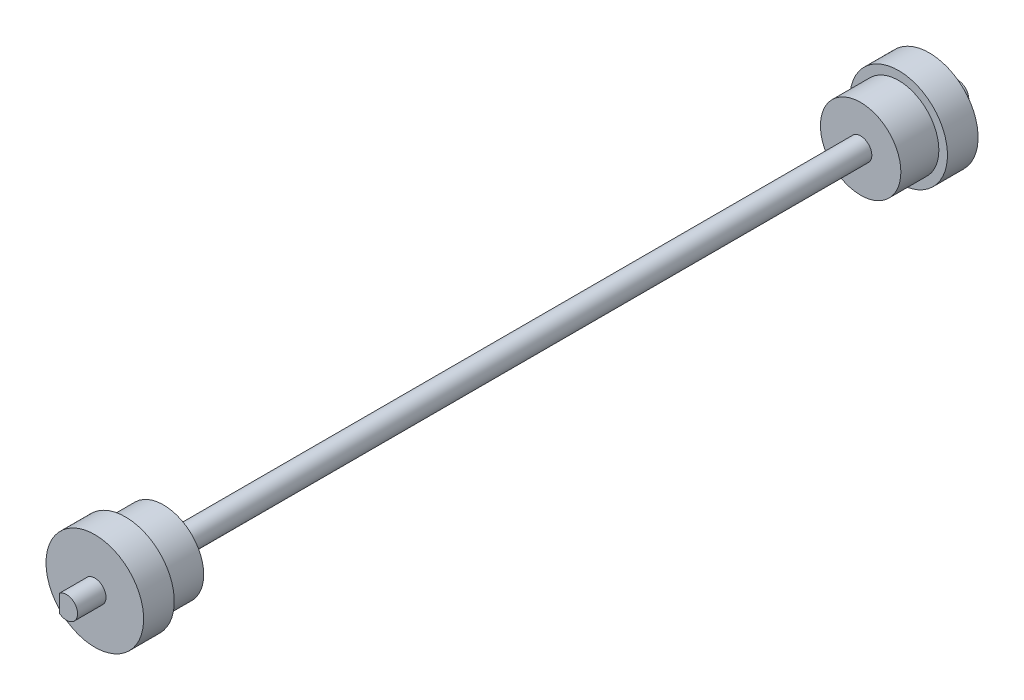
ISO-10303-21;
HEADER;
FILE_DESCRIPTION(('STEP AP214'),'2;1');
FILE_NAME('part.step','',(''),(''),'','','');
FILE_SCHEMA(('AUTOMOTIVE_DESIGN { 1 0 10303 214 1 1 1 1 }'));
ENDSEC;
DATA;
#1=APPLICATION_CONTEXT('core data for automotive mechanical design processes');
#2=APPLICATION_PROTOCOL_DEFINITION('international standard','automotive_design',2000,#1);
#3=PRODUCT_CONTEXT('',#1,'mechanical');
#4=PRODUCT('Part','Part','',(#3));
#5=PRODUCT_RELATED_PRODUCT_CATEGORY('part','',(#4));
#6=PRODUCT_DEFINITION_FORMATION('','',#4);
#7=PRODUCT_DEFINITION_CONTEXT('part definition',#1,'design');
#8=PRODUCT_DEFINITION('design','',#6,#7);
#9=PRODUCT_DEFINITION_SHAPE('','',#8);
#10=(LENGTH_UNIT() NAMED_UNIT(*) SI_UNIT(.MILLI.,.METRE.));
#11=(NAMED_UNIT(*) PLANE_ANGLE_UNIT() SI_UNIT($,.RADIAN.));
#12=(NAMED_UNIT(*) SI_UNIT($,.STERADIAN.) SOLID_ANGLE_UNIT());
#13=UNCERTAINTY_MEASURE_WITH_UNIT(LENGTH_MEASURE(1.E-05),#10,'distance_accuracy_value','');
#14=(GEOMETRIC_REPRESENTATION_CONTEXT(3) GLOBAL_UNCERTAINTY_ASSIGNED_CONTEXT((#13)) GLOBAL_UNIT_ASSIGNED_CONTEXT((#10,
#11,#12)) REPRESENTATION_CONTEXT('',''));
#15=CARTESIAN_POINT('',(0.,0.,0.));
#16=DIRECTION('',(0.,0.,1.));
#17=DIRECTION('',(1.,0.,0.));
#18=AXIS2_PLACEMENT_3D('',#15,#16,#17);
#19=CARTESIAN_POINT('',(0.,0.,21.708));
#20=DIRECTION('',(0.,0.,1.));
#21=DIRECTION('',(1.,0.,0.));
#22=AXIS2_PLACEMENT_3D('',#19,#20,#21);
#23=PLANE('',#22);
#24=CARTESIAN_POINT('',(0.,0.,21.708));
#25=DIRECTION('',(0.,0.,1.));
#26=DIRECTION('',(1.,0.,0.));
#27=AXIS2_PLACEMENT_3D('',#24,#25,#26);
#28=CIRCLE('',#27,9.);
#29=CARTESIAN_POINT('',(9.,0.,21.708));
#30=VERTEX_POINT('',#29);
#31=EDGE_CURVE('E12',#30,#30,#28,.T.);
#32=ORIENTED_EDGE('',*,*,#31,.T.);
#33=EDGE_LOOP('',(#32));
#34=FACE_BOUND('',#33,.T.);
#35=CARTESIAN_POINT('',(0.,0.,21.708));
#36=DIRECTION('',(0.,0.,1.));
#37=DIRECTION('',(1.,0.,0.));
#38=AXIS2_PLACEMENT_3D('',#35,#36,#37);
#39=CIRCLE('',#38,2.5);
#40=CARTESIAN_POINT('',(2.5,0.,21.708));
#41=VERTEX_POINT('',#40);
#42=EDGE_CURVE('E57',#41,#41,#39,.T.);
#43=ORIENTED_EDGE('',*,*,#42,.F.);
#44=EDGE_LOOP('',(#43));
#45=FACE_BOUND('',#44,.T.);
#46=ADVANCED_FACE('F46',(#34,#45),#23,.T.);
#47=CARTESIAN_POINT('',(0.,0.,13.208));
#48=DIRECTION('',(0.,0.,1.));
#49=DIRECTION('',(1.,0.,0.));
#50=AXIS2_PLACEMENT_3D('',#47,#48,#49);
#51=PLANE('',#50);
#52=CARTESIAN_POINT('',(0.,0.,13.208));
#53=DIRECTION('',(0.,0.,1.));
#54=DIRECTION('',(1.,0.,0.));
#55=AXIS2_PLACEMENT_3D('',#52,#53,#54);
#56=CIRCLE('',#55,9.);
#57=CARTESIAN_POINT('',(9.,0.,13.208));
#58=VERTEX_POINT('',#57);
#59=EDGE_CURVE('E50',#58,#58,#56,.T.);
#60=ORIENTED_EDGE('',*,*,#59,.F.);
#61=EDGE_LOOP('',(#60));
#62=FACE_BOUND('',#61,.T.);
#63=CARTESIAN_POINT('',(0.,0.,13.208));
#64=DIRECTION('',(0.,0.,1.));
#65=DIRECTION('',(1.,0.,0.));
#66=AXIS2_PLACEMENT_3D('',#63,#64,#65);
#67=CIRCLE('',#66,2.5);
#68=CARTESIAN_POINT('',(2.5,0.,13.208));
#69=VERTEX_POINT('',#68);
#70=EDGE_CURVE('E59',#69,#69,#67,.T.);
#71=ORIENTED_EDGE('',*,*,#70,.T.);
#72=EDGE_LOOP('',(#71));
#73=FACE_BOUND('',#72,.T.);
#74=ADVANCED_FACE('F69',(#62,#73),#51,.F.);
#75=CARTESIAN_POINT('',(0.,0.,21.708));
#76=DIRECTION('',(0.,0.,-1.));
#77=DIRECTION('',(-1.,0.,0.));
#78=AXIS2_PLACEMENT_3D('',#75,#76,#77);
#79=CYLINDRICAL_SURFACE('',#78,9.);
#80=ORIENTED_EDGE('',*,*,#31,.F.);
#81=EDGE_LOOP('',(#80));
#82=FACE_BOUND('',#81,.T.);
#83=ORIENTED_EDGE('',*,*,#59,.T.);
#84=EDGE_LOOP('',(#83));
#85=FACE_BOUND('',#84,.T.);
#86=ADVANCED_FACE('F48',(#82,#85),#79,.T.);
#87=CARTESIAN_POINT('',(0.,0.,21.708));
#88=DIRECTION('',(0.,0.,-1.));
#89=DIRECTION('',(-1.,0.,0.));
#90=AXIS2_PLACEMENT_3D('',#87,#88,#89);
#91=CYLINDRICAL_SURFACE('',#90,2.5);
#92=ORIENTED_EDGE('',*,*,#42,.T.);
#93=EDGE_LOOP('',(#92));
#94=FACE_BOUND('',#93,.T.);
#95=ORIENTED_EDGE('',*,*,#70,.F.);
#96=EDGE_LOOP('',(#95));
#97=FACE_BOUND('',#96,.T.);
#98=ADVANCED_FACE('F65',(#94,#97),#91,.F.);
#99=CLOSED_SHELL('',(#46,#74,#86,#98));
#100=MANIFOLD_SOLID_BREP('B2',#99);
#101=CARTESIAN_POINT('',(0.,0.,13.208));
#102=DIRECTION('',(0.,0.,-1.));
#103=DIRECTION('',(-1.,0.,0.));
#104=AXIS2_PLACEMENT_3D('',#101,#102,#103);
#105=CYLINDRICAL_SURFACE('',#104,10.922);
#106=CARTESIAN_POINT('',(0.,0.,13.208));
#107=DIRECTION('',(0.,0.,-1.));
#108=DIRECTION('',(-1.,0.,0.));
#109=AXIS2_PLACEMENT_3D('',#106,#107,#108);
#110=CIRCLE('',#109,10.922);
#111=CARTESIAN_POINT('',(-10.922,0.,13.208));
#112=VERTEX_POINT('',#111);
#113=EDGE_CURVE('E45',#112,#112,#110,.T.);
#114=ORIENTED_EDGE('',*,*,#113,.T.);
#115=EDGE_LOOP('',(#114));
#116=FACE_BOUND('',#115,.T.);
#117=CARTESIAN_POINT('',(0.,0.,6.35));
#118=DIRECTION('',(0.,0.,-1.));
#119=DIRECTION('',(-1.,0.,0.));
#120=AXIS2_PLACEMENT_3D('',#117,#118,#119);
#121=CIRCLE('',#120,10.922);
#122=CARTESIAN_POINT('',(-10.922,0.,6.35));
#123=VERTEX_POINT('',#122);
#124=EDGE_CURVE('E120',#123,#123,#121,.T.);
#125=ORIENTED_EDGE('',*,*,#124,.F.);
#126=EDGE_LOOP('',(#125));
#127=FACE_BOUND('',#126,.T.);
#128=ADVANCED_FACE('F117',(#116,#127),#105,.T.);
#129=CARTESIAN_POINT('',(0.,0.,13.208));
#130=DIRECTION('',(0.,0.,-1.));
#131=DIRECTION('',(-1.,0.,0.));
#132=AXIS2_PLACEMENT_3D('',#129,#130,#131);
#133=PLANE('',#132);
#134=CARTESIAN_POINT('',(0.,0.,13.208));
#135=DIRECTION('',(0.,0.,-1.));
#136=DIRECTION('',(-1.,0.,0.));
#137=AXIS2_PLACEMENT_3D('',#134,#135,#136);
#138=CIRCLE('',#137,2.5);
#139=CARTESIAN_POINT('',(-2.5,0.,13.208));
#140=VERTEX_POINT('',#139);
#141=EDGE_CURVE('E127',#140,#140,#138,.T.);
#142=ORIENTED_EDGE('',*,*,#141,.T.);
#143=EDGE_LOOP('',(#142));
#144=FACE_BOUND('',#143,.T.);
#145=ORIENTED_EDGE('',*,*,#113,.F.);
#146=EDGE_LOOP('',(#145));
#147=FACE_BOUND('',#146,.T.);
#148=ADVANCED_FACE('F135',(#144,#147),#133,.F.);
#149=CARTESIAN_POINT('',(0.,0.,6.35));
#150=DIRECTION('',(0.,0.,-1.));
#151=DIRECTION('',(-1.,0.,0.));
#152=AXIS2_PLACEMENT_3D('',#149,#150,#151);
#153=PLANE('',#152);
#154=CARTESIAN_POINT('',(0.,0.,6.35));
#155=DIRECTION('',(0.,0.,-1.));
#156=DIRECTION('',(-1.,0.,0.));
#157=AXIS2_PLACEMENT_3D('',#154,#155,#156);
#158=CIRCLE('',#157,2.5);
#159=CARTESIAN_POINT('',(-2.5,0.,6.35));
#160=VERTEX_POINT('',#159);
#161=EDGE_CURVE('E129',#160,#160,#158,.T.);
#162=ORIENTED_EDGE('',*,*,#161,.F.);
#163=EDGE_LOOP('',(#162));
#164=FACE_BOUND('',#163,.T.);
#165=ORIENTED_EDGE('',*,*,#124,.T.);
#166=EDGE_LOOP('',(#165));
#167=FACE_BOUND('',#166,.T.);
#168=ADVANCED_FACE('F141',(#164,#167),#153,.T.);
#169=CARTESIAN_POINT('',(0.,0.,13.208));
#170=DIRECTION('',(0.,0.,-1.));
#171=DIRECTION('',(-1.,0.,0.));
#172=AXIS2_PLACEMENT_3D('',#169,#170,#171);
#173=CYLINDRICAL_SURFACE('',#172,2.5);
#174=ORIENTED_EDGE('',*,*,#141,.F.);
#175=EDGE_LOOP('',(#174));
#176=FACE_BOUND('',#175,.T.);
#177=ORIENTED_EDGE('',*,*,#161,.T.);
#178=EDGE_LOOP('',(#177));
#179=FACE_BOUND('',#178,.T.);
#180=ADVANCED_FACE('F138',(#176,#179),#173,.F.);
#181=CLOSED_SHELL('',(#128,#148,#168,#180));
#182=MANIFOLD_SOLID_BREP('B7',#181);
#183=CARTESIAN_POINT('',(0.,0.,199.39));
#184=DIRECTION('',(0.,0.,-1.));
#185=DIRECTION('',(-1.,0.,0.));
#186=AXIS2_PLACEMENT_3D('',#183,#184,#185);
#187=CYLINDRICAL_SURFACE('',#186,2.5);
#188=DIRECTION('',(0.,0.,-1.));
#189=VECTOR('',#188,1.);
#190=CARTESIAN_POINT('',(-1.57121532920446,-1.94455197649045,199.39));
#191=LINE('',#190,#189);
#192=CARTESIAN_POINT('',(-1.57121532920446,-1.94455197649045,199.39));
#193=VERTEX_POINT('',#192);
#194=CARTESIAN_POINT('',(-1.57121532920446,-1.94455197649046,193.04));
#195=VERTEX_POINT('',#194);
#196=EDGE_CURVE('E222',#193,#195,#191,.T.);
#197=ORIENTED_EDGE('',*,*,#196,.T.);
#198=CARTESIAN_POINT('',(0.,0.,193.04));
#199=DIRECTION('',(0.,0.,-1.));
#200=DIRECTION('',(-1.,0.,0.));
#201=AXIS2_PLACEMENT_3D('',#198,#199,#200);
#202=CIRCLE('',#201,2.5);
#203=CARTESIAN_POINT('',(-1.57121532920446,1.94455197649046,193.04));
#204=VERTEX_POINT('',#203);
#205=EDGE_CURVE('E260',#204,#195,#202,.T.);
#206=ORIENTED_EDGE('',*,*,#205,.F.);
#207=DIRECTION('',(0.,0.,-1.));
#208=VECTOR('',#207,1.);
#209=CARTESIAN_POINT('',(-1.57121532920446,1.94455197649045,199.39));
#210=LINE('',#209,#208);
#211=CARTESIAN_POINT('',(-1.57121532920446,1.94455197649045,199.39));
#212=VERTEX_POINT('',#211);
#213=EDGE_CURVE('E115',#212,#204,#210,.T.);
#214=ORIENTED_EDGE('',*,*,#213,.F.);
#215=CARTESIAN_POINT('',(0.,0.,199.39));
#216=DIRECTION('',(0.,0.,1.));
#217=DIRECTION('',(1.,0.,0.));
#218=AXIS2_PLACEMENT_3D('',#215,#216,#217);
#219=CIRCLE('',#218,2.5);
#220=EDGE_CURVE('E227',#193,#212,#219,.T.);
#221=ORIENTED_EDGE('',*,*,#220,.F.);
#222=EDGE_LOOP('',(#197,#206,#214,#221));
#223=FACE_BOUND('',#222,.T.);
#224=ADVANCED_FACE('F179',(#223),#187,.T.);
#225=CARTESIAN_POINT('',(-1.57121532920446,1.94455197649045,177.682));
#226=VERTEX_POINT('',#225);
#227=CARTESIAN_POINT('',(-1.57121532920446,1.94455197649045,0.));
#228=VERTEX_POINT('',#227);
#229=EDGE_CURVE('E188',#226,#228,#210,.T.);
#230=ORIENTED_EDGE('',*,*,#229,.F.);
#231=CARTESIAN_POINT('',(0.,0.,177.682));
#232=DIRECTION('',(0.,0.,1.));
#233=DIRECTION('',(1.,0.,0.));
#234=AXIS2_PLACEMENT_3D('',#231,#232,#233);
#235=CIRCLE('',#234,2.5);
#236=CARTESIAN_POINT('',(-1.57121532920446,-1.94455197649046,177.682));
#237=VERTEX_POINT('',#236);
#238=EDGE_CURVE('E217',#237,#226,#235,.T.);
#239=ORIENTED_EDGE('',*,*,#238,.F.);
#240=CARTESIAN_POINT('',(-1.57121532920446,-1.94455197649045,0.));
#241=VERTEX_POINT('',#240);
#242=EDGE_CURVE('E212',#237,#241,#191,.T.);
#243=ORIENTED_EDGE('',*,*,#242,.T.);
#244=CARTESIAN_POINT('',(0.,0.,0.));
#245=DIRECTION('',(0.,0.,1.));
#246=DIRECTION('',(1.,0.,0.));
#247=AXIS2_PLACEMENT_3D('',#244,#245,#246);
#248=CIRCLE('',#247,2.5);
#249=EDGE_CURVE('E215',#241,#228,#248,.T.);
#250=ORIENTED_EDGE('',*,*,#249,.T.);
#251=EDGE_LOOP('',(#230,#239,#243,#250));
#252=FACE_BOUND('',#251,.T.);
#253=ADVANCED_FACE('F181',(#252),#187,.T.);
#254=CARTESIAN_POINT('',(-1.57121532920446,1.94455197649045,199.39));
#255=DIRECTION('',(1.,0.,0.));
#256=DIRECTION('',(0.,0.,-1.));
#257=AXIS2_PLACEMENT_3D('',#254,#255,#256);
#258=PLANE('',#257);
#259=DIRECTION('',(0.,-1.,0.));
#260=VECTOR('',#259,1.);
#261=CARTESIAN_POINT('',(-1.57121532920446,1.94455197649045,0.));
#262=LINE('',#261,#260);
#263=EDGE_CURVE('E224',#228,#241,#262,.T.);
#264=ORIENTED_EDGE('',*,*,#263,.T.);
#265=ORIENTED_EDGE('',*,*,#242,.F.);
#266=EDGE_CURVE('E221',#195,#237,#191,.T.);
#267=ORIENTED_EDGE('',*,*,#266,.F.);
#268=ORIENTED_EDGE('',*,*,#196,.F.);
#269=DIRECTION('',(0.,-1.,0.));
#270=VECTOR('',#269,1.);
#271=CARTESIAN_POINT('',(-1.57121532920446,1.94455197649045,199.39));
#272=LINE('',#271,#270);
#273=EDGE_CURVE('E202',#212,#193,#272,.T.);
#274=ORIENTED_EDGE('',*,*,#273,.F.);
#275=ORIENTED_EDGE('',*,*,#213,.T.);
#276=EDGE_CURVE('E187',#204,#226,#210,.T.);
#277=ORIENTED_EDGE('',*,*,#276,.T.);
#278=ORIENTED_EDGE('',*,*,#229,.T.);
#279=EDGE_LOOP('',(#264,#265,#267,#268,#274,#275,#277,#278));
#280=FACE_BOUND('',#279,.T.);
#281=ADVANCED_FACE('F225',(#280),#258,.F.);
#282=CARTESIAN_POINT('',(0.,0.,199.39));
#283=DIRECTION('',(0.,0.,1.));
#284=DIRECTION('',(1.,0.,0.));
#285=AXIS2_PLACEMENT_3D('',#282,#283,#284);
#286=PLANE('',#285);
#287=ORIENTED_EDGE('',*,*,#220,.T.);
#288=ORIENTED_EDGE('',*,*,#273,.T.);
#289=EDGE_LOOP('',(#287,#288));
#290=FACE_BOUND('',#289,.T.);
#291=ADVANCED_FACE('F258',(#290),#286,.T.);
#292=CARTESIAN_POINT('',(0.,0.,0.));
#293=DIRECTION('',(0.,0.,1.));
#294=DIRECTION('',(1.,0.,0.));
#295=AXIS2_PLACEMENT_3D('',#292,#293,#294);
#296=PLANE('',#295);
#297=ORIENTED_EDGE('',*,*,#249,.F.);
#298=ORIENTED_EDGE('',*,*,#263,.F.);
#299=EDGE_LOOP('',(#297,#298));
#300=FACE_BOUND('',#299,.T.);
#301=ADVANCED_FACE('F229',(#300),#296,.F.);
#302=CARTESIAN_POINT('',(0.,0.,177.682));
#303=DIRECTION('',(0.,0.,1.));
#304=DIRECTION('',(-1.,0.,0.));
#305=AXIS2_PLACEMENT_3D('',#302,#303,#304);
#306=CYLINDRICAL_SURFACE('',#305,2.5);
#307=ORIENTED_EDGE('',*,*,#276,.F.);
#308=EDGE_CURVE('E249',#195,#204,#202,.T.);
#309=ORIENTED_EDGE('',*,*,#308,.F.);
#310=ORIENTED_EDGE('',*,*,#266,.T.);
#311=EDGE_CURVE('E233',#226,#237,#235,.T.);
#312=ORIENTED_EDGE('',*,*,#311,.F.);
#313=EDGE_LOOP('',(#307,#309,#310,#312));
#314=FACE_BOUND('',#313,.T.);
#315=ADVANCED_FACE('F247',(#314),#306,.F.);
#316=CARTESIAN_POINT('',(0.,0.,177.682));
#317=DIRECTION('',(0.,0.,-1.));
#318=DIRECTION('',(1.,0.,0.));
#319=AXIS2_PLACEMENT_3D('',#316,#317,#318);
#320=PLANE('',#319);
#321=CARTESIAN_POINT('',(0.,0.,177.682));
#322=DIRECTION('',(0.,0.,1.));
#323=DIRECTION('',(1.,0.,0.));
#324=AXIS2_PLACEMENT_3D('',#321,#322,#323);
#325=CIRCLE('',#324,9.);
#326=CARTESIAN_POINT('',(9.,0.,177.682));
#327=VERTEX_POINT('',#326);
#328=EDGE_CURVE('E254',#327,#327,#325,.T.);
#329=ORIENTED_EDGE('',*,*,#328,.F.);
#330=EDGE_LOOP('',(#329));
#331=FACE_BOUND('',#330,.T.);
#332=ORIENTED_EDGE('',*,*,#311,.T.);
#333=ORIENTED_EDGE('',*,*,#238,.T.);
#334=EDGE_LOOP('',(#332,#333));
#335=FACE_BOUND('',#334,.T.);
#336=ADVANCED_FACE('F252',(#331,#335),#320,.T.);
#337=CARTESIAN_POINT('',(0.,0.,177.682));
#338=DIRECTION('',(0.,0.,1.));
#339=DIRECTION('',(-1.,0.,0.));
#340=AXIS2_PLACEMENT_3D('',#337,#338,#339);
#341=CYLINDRICAL_SURFACE('',#340,9.);
#342=ORIENTED_EDGE('',*,*,#328,.T.);
#343=EDGE_LOOP('',(#342));
#344=FACE_BOUND('',#343,.T.);
#345=CARTESIAN_POINT('',(0.,0.,186.182));
#346=DIRECTION('',(0.,0.,1.));
#347=DIRECTION('',(1.,0.,0.));
#348=AXIS2_PLACEMENT_3D('',#345,#346,#347);
#349=CIRCLE('',#348,9.);
#350=CARTESIAN_POINT('',(9.,0.,186.182));
#351=VERTEX_POINT('',#350);
#352=EDGE_CURVE('E230',#351,#351,#349,.T.);
#353=ORIENTED_EDGE('',*,*,#352,.F.);
#354=EDGE_LOOP('',(#353));
#355=FACE_BOUND('',#354,.T.);
#356=ADVANCED_FACE('F279',(#344,#355),#341,.T.);
#357=CARTESIAN_POINT('',(0.,0.,186.182));
#358=DIRECTION('',(0.,0.,1.));
#359=DIRECTION('',(-1.,0.,0.));
#360=AXIS2_PLACEMENT_3D('',#357,#358,#359);
#361=CYLINDRICAL_SURFACE('',#360,10.922);
#362=CARTESIAN_POINT('',(0.,0.,186.182));
#363=DIRECTION('',(0.,0.,-1.));
#364=DIRECTION('',(-1.,0.,0.));
#365=AXIS2_PLACEMENT_3D('',#362,#363,#364);
#366=CIRCLE('',#365,10.922);
#367=CARTESIAN_POINT('',(-10.922,0.,186.182));
#368=VERTEX_POINT('',#367);
#369=EDGE_CURVE('E268',#368,#368,#366,.T.);
#370=ORIENTED_EDGE('',*,*,#369,.F.);
#371=EDGE_LOOP('',(#370));
#372=FACE_BOUND('',#371,.T.);
#373=CARTESIAN_POINT('',(0.,0.,193.04));
#374=DIRECTION('',(0.,0.,-1.));
#375=DIRECTION('',(-1.,0.,0.));
#376=AXIS2_PLACEMENT_3D('',#373,#374,#375);
#377=CIRCLE('',#376,10.922);
#378=CARTESIAN_POINT('',(-10.922,0.,193.04));
#379=VERTEX_POINT('',#378);
#380=EDGE_CURVE('E266',#379,#379,#377,.T.);
#381=ORIENTED_EDGE('',*,*,#380,.T.);
#382=EDGE_LOOP('',(#381));
#383=FACE_BOUND('',#382,.T.);
#384=ADVANCED_FACE('F276',(#372,#383),#361,.T.);
#385=CARTESIAN_POINT('',(0.,0.,186.182));
#386=DIRECTION('',(0.,0.,1.));
#387=DIRECTION('',(-1.,0.,0.));
#388=AXIS2_PLACEMENT_3D('',#385,#386,#387);
#389=PLANE('',#388);
#390=ORIENTED_EDGE('',*,*,#352,.T.);
#391=EDGE_LOOP('',(#390));
#392=FACE_BOUND('',#391,.T.);
#393=ORIENTED_EDGE('',*,*,#369,.T.);
#394=EDGE_LOOP('',(#393));
#395=FACE_BOUND('',#394,.T.);
#396=ADVANCED_FACE('F274',(#392,#395),#389,.F.);
#397=CARTESIAN_POINT('',(0.,0.,193.04));
#398=DIRECTION('',(0.,0.,1.));
#399=DIRECTION('',(-1.,0.,0.));
#400=AXIS2_PLACEMENT_3D('',#397,#398,#399);
#401=PLANE('',#400);
#402=ORIENTED_EDGE('',*,*,#205,.T.);
#403=ORIENTED_EDGE('',*,*,#308,.T.);
#404=EDGE_LOOP('',(#402,#403));
#405=FACE_BOUND('',#404,.T.);
#406=ORIENTED_EDGE('',*,*,#380,.F.);
#407=EDGE_LOOP('',(#406));
#408=FACE_BOUND('',#407,.T.);
#409=ADVANCED_FACE('F264',(#405,#408),#401,.T.);
#410=CLOSED_SHELL('',(#224,#253,#281,#291,#301,#315,#336,#356,#384,#396,#409));
#411=MANIFOLD_SOLID_BREP('B40',#410);
#412=ADVANCED_BREP_SHAPE_REPRESENTATION('',(#18,#100,#182,#411),#14);
#413=SHAPE_DEFINITION_REPRESENTATION(#9,#412);
ENDSEC;
END-ISO-10303-21;
